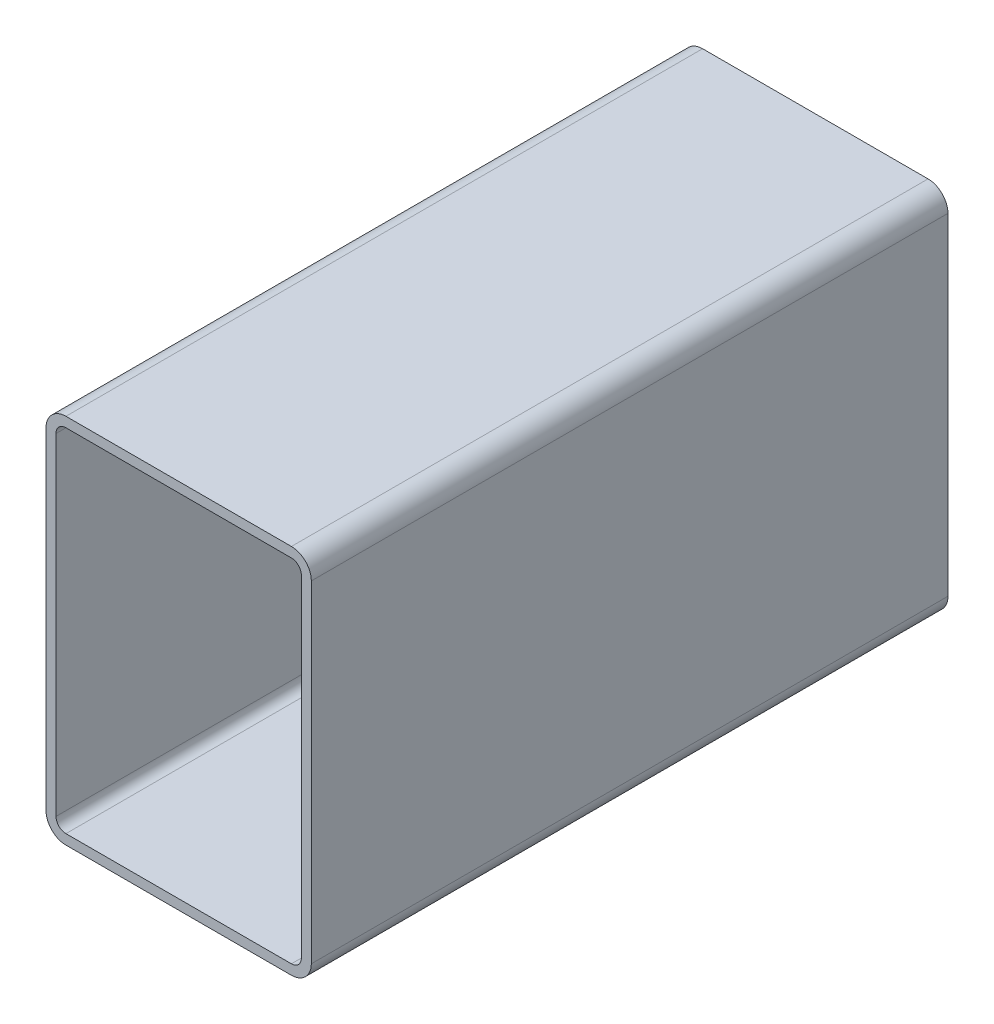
ISO-10303-21;
HEADER;
FILE_DESCRIPTION(('STEP AP214'),'2;1');
FILE_NAME('part.step','',(''),(''),'','','');
FILE_SCHEMA(('AUTOMOTIVE_DESIGN { 1 0 10303 214 1 1 1 1 }'));
ENDSEC;
DATA;
#1=APPLICATION_CONTEXT('core data for automotive mechanical design processes');
#2=APPLICATION_PROTOCOL_DEFINITION('international standard','automotive_design',2000,#1);
#3=PRODUCT_CONTEXT('',#1,'mechanical');
#4=PRODUCT('Part','Part','',(#3));
#5=PRODUCT_RELATED_PRODUCT_CATEGORY('part','',(#4));
#6=PRODUCT_DEFINITION_FORMATION('','',#4);
#7=PRODUCT_DEFINITION_CONTEXT('part definition',#1,'design');
#8=PRODUCT_DEFINITION('design','',#6,#7);
#9=PRODUCT_DEFINITION_SHAPE('','',#8);
#10=(LENGTH_UNIT() NAMED_UNIT(*) SI_UNIT(.MILLI.,.METRE.));
#11=(NAMED_UNIT(*) PLANE_ANGLE_UNIT() SI_UNIT($,.RADIAN.));
#12=(NAMED_UNIT(*) SI_UNIT($,.STERADIAN.) SOLID_ANGLE_UNIT());
#13=UNCERTAINTY_MEASURE_WITH_UNIT(LENGTH_MEASURE(1.E-05),#10,'distance_accuracy_value','');
#14=(GEOMETRIC_REPRESENTATION_CONTEXT(3) GLOBAL_UNCERTAINTY_ASSIGNED_CONTEXT((#13)) GLOBAL_UNIT_ASSIGNED_CONTEXT((#10,
#11,#12)) REPRESENTATION_CONTEXT('',''));
#15=CARTESIAN_POINT('',(0.,0.,0.));
#16=DIRECTION('',(0.,0.,1.));
#17=DIRECTION('',(1.,0.,0.));
#18=AXIS2_PLACEMENT_3D('',#15,#16,#17);
#19=CARTESIAN_POINT('',(10.3862396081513,170.264039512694,304.8));
#20=DIRECTION('',(0.,0.,1.));
#21=DIRECTION('',(1.,0.,0.));
#22=AXIS2_PLACEMENT_3D('',#19,#20,#21);
#23=PLANE('',#22);
#24=CARTESIAN_POINT('',(10.3862396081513,170.264039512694,304.8));
#25=DIRECTION('',(0.,0.,1.));
#26=DIRECTION('',(1.,0.,0.));
#27=AXIS2_PLACEMENT_3D('',#24,#25,#26);
#28=CIRCLE('',#27,9.525);
#29=CARTESIAN_POINT('',(10.3862396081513,179.789039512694,304.8));
#30=VERTEX_POINT('',#29);
#31=CARTESIAN_POINT('',(0.8612396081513,170.264039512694,304.8));
#32=VERTEX_POINT('',#31);
#33=EDGE_CURVE('E211',#30,#32,#28,.T.);
#34=ORIENTED_EDGE('',*,*,#33,.T.);
#35=DIRECTION('',(0.,-1.,0.));
#36=VECTOR('',#35,1.);
#37=CARTESIAN_POINT('',(0.8612396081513,11.5140395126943,304.8));
#38=LINE('',#37,#36);
#39=CARTESIAN_POINT('',(0.861239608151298,11.5140395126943,304.8));
#40=VERTEX_POINT('',#39);
#41=EDGE_CURVE('E214',#32,#40,#38,.T.);
#42=ORIENTED_EDGE('',*,*,#41,.T.);
#43=CARTESIAN_POINT('',(10.3862396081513,11.5140395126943,304.8));
#44=DIRECTION('',(0.,0.,1.));
#45=DIRECTION('',(1.,0.,0.));
#46=AXIS2_PLACEMENT_3D('',#43,#44,#45);
#47=CIRCLE('',#46,9.525);
#48=CARTESIAN_POINT('',(10.3862396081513,1.98903951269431,304.8));
#49=VERTEX_POINT('',#48);
#50=EDGE_CURVE('E217',#40,#49,#47,.T.);
#51=ORIENTED_EDGE('',*,*,#50,.T.);
#52=DIRECTION('',(1.,0.,0.));
#53=VECTOR('',#52,1.);
#54=CARTESIAN_POINT('',(118.336239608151,1.98903951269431,304.8));
#55=LINE('',#54,#53);
#56=CARTESIAN_POINT('',(118.336239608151,1.98903951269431,304.8));
#57=VERTEX_POINT('',#56);
#58=EDGE_CURVE('E219',#49,#57,#55,.T.);
#59=ORIENTED_EDGE('',*,*,#58,.T.);
#60=CARTESIAN_POINT('',(118.336239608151,11.5140395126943,304.8));
#61=DIRECTION('',(0.,0.,1.));
#62=DIRECTION('',(1.,0.,0.));
#63=AXIS2_PLACEMENT_3D('',#60,#61,#62);
#64=CIRCLE('',#63,9.525);
#65=CARTESIAN_POINT('',(127.861239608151,11.5140395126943,304.8));
#66=VERTEX_POINT('',#65);
#67=EDGE_CURVE('E221',#57,#66,#64,.T.);
#68=ORIENTED_EDGE('',*,*,#67,.T.);
#69=DIRECTION('',(0.,1.,0.));
#70=VECTOR('',#69,1.);
#71=CARTESIAN_POINT('',(127.861239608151,170.264039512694,304.8));
#72=LINE('',#71,#70);
#73=CARTESIAN_POINT('',(127.861239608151,170.264039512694,304.8));
#74=VERTEX_POINT('',#73);
#75=EDGE_CURVE('E223',#66,#74,#72,.T.);
#76=ORIENTED_EDGE('',*,*,#75,.T.);
#77=CARTESIAN_POINT('',(118.336239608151,170.264039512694,304.8));
#78=DIRECTION('',(0.,0.,1.));
#79=DIRECTION('',(1.,0.,0.));
#80=AXIS2_PLACEMENT_3D('',#77,#78,#79);
#81=CIRCLE('',#80,9.525);
#82=CARTESIAN_POINT('',(118.336239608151,179.789039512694,304.8));
#83=VERTEX_POINT('',#82);
#84=EDGE_CURVE('E225',#74,#83,#81,.T.);
#85=ORIENTED_EDGE('',*,*,#84,.T.);
#86=DIRECTION('',(-1.,0.,0.));
#87=VECTOR('',#86,1.);
#88=CARTESIAN_POINT('',(10.3862396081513,179.789039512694,304.8));
#89=LINE('',#88,#87);
#90=EDGE_CURVE('E227',#83,#30,#89,.T.);
#91=ORIENTED_EDGE('',*,*,#90,.T.);
#92=EDGE_LOOP('',(#34,#42,#51,#59,#68,#76,#85,#91));
#93=FACE_BOUND('',#92,.T.);
#94=DIRECTION('',(0.,-1.,0.));
#95=VECTOR('',#94,1.);
#96=CARTESIAN_POINT('',(5.6237396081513,11.5140395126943,304.8));
#97=LINE('',#96,#95);
#98=CARTESIAN_POINT('',(5.6237396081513,170.264039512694,304.8));
#99=VERTEX_POINT('',#98);
#100=CARTESIAN_POINT('',(5.6237396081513,11.5140395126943,304.8));
#101=VERTEX_POINT('',#100);
#102=EDGE_CURVE('E154',#99,#101,#97,.T.);
#103=ORIENTED_EDGE('',*,*,#102,.F.);
#104=CARTESIAN_POINT('',(10.3862396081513,170.264039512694,304.8));
#105=DIRECTION('',(0.,0.,1.));
#106=DIRECTION('',(1.,0.,0.));
#107=AXIS2_PLACEMENT_3D('',#104,#105,#106);
#108=CIRCLE('',#107,4.7625);
#109=CARTESIAN_POINT('',(10.3862396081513,175.026539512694,304.8));
#110=VERTEX_POINT('',#109);
#111=EDGE_CURVE('E146',#110,#99,#108,.T.);
#112=ORIENTED_EDGE('',*,*,#111,.F.);
#113=DIRECTION('',(-1.,0.,0.));
#114=VECTOR('',#113,1.);
#115=CARTESIAN_POINT('',(10.3862396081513,175.026539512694,304.8));
#116=LINE('',#115,#114);
#117=CARTESIAN_POINT('',(118.336239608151,175.026539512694,304.8));
#118=VERTEX_POINT('',#117);
#119=EDGE_CURVE('E179',#118,#110,#116,.T.);
#120=ORIENTED_EDGE('',*,*,#119,.F.);
#121=CARTESIAN_POINT('',(118.336239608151,170.264039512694,304.8));
#122=DIRECTION('',(0.,0.,1.));
#123=DIRECTION('',(1.,0.,0.));
#124=AXIS2_PLACEMENT_3D('',#121,#122,#123);
#125=CIRCLE('',#124,4.7625);
#126=CARTESIAN_POINT('',(123.098739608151,170.264039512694,304.8));
#127=VERTEX_POINT('',#126);
#128=EDGE_CURVE('E177',#127,#118,#125,.T.);
#129=ORIENTED_EDGE('',*,*,#128,.F.);
#130=DIRECTION('',(0.,1.,0.));
#131=VECTOR('',#130,1.);
#132=CARTESIAN_POINT('',(123.098739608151,170.264039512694,304.8));
#133=LINE('',#132,#131);
#134=CARTESIAN_POINT('',(123.098739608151,11.5140395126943,304.8));
#135=VERTEX_POINT('',#134);
#136=EDGE_CURVE('E175',#135,#127,#133,.T.);
#137=ORIENTED_EDGE('',*,*,#136,.F.);
#138=CARTESIAN_POINT('',(118.336239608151,11.5140395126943,304.8));
#139=DIRECTION('',(0.,0.,1.));
#140=DIRECTION('',(1.,0.,0.));
#141=AXIS2_PLACEMENT_3D('',#138,#139,#140);
#142=CIRCLE('',#141,4.7625);
#143=CARTESIAN_POINT('',(118.336239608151,6.75153951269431,304.8));
#144=VERTEX_POINT('',#143);
#145=EDGE_CURVE('E173',#144,#135,#142,.T.);
#146=ORIENTED_EDGE('',*,*,#145,.F.);
#147=DIRECTION('',(1.,0.,0.));
#148=VECTOR('',#147,1.);
#149=CARTESIAN_POINT('',(118.336239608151,6.75153951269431,304.8));
#150=LINE('',#149,#148);
#151=CARTESIAN_POINT('',(10.3862396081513,6.75153951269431,304.8));
#152=VERTEX_POINT('',#151);
#153=EDGE_CURVE('E169',#152,#144,#150,.T.);
#154=ORIENTED_EDGE('',*,*,#153,.F.);
#155=CARTESIAN_POINT('',(10.3862396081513,11.5140395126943,304.8));
#156=DIRECTION('',(0.,0.,1.));
#157=DIRECTION('',(1.,0.,0.));
#158=AXIS2_PLACEMENT_3D('',#155,#156,#157);
#159=CIRCLE('',#158,4.7625);
#160=EDGE_CURVE('E167',#101,#152,#159,.T.);
#161=ORIENTED_EDGE('',*,*,#160,.F.);
#162=EDGE_LOOP('',(#103,#112,#120,#129,#137,#146,#154,#161));
#163=FACE_BOUND('',#162,.T.);
#164=ADVANCED_FACE('F33',(#93,#163),#23,.T.);
#165=CARTESIAN_POINT('',(10.3862396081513,170.264039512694,0.));
#166=DIRECTION('',(0.,0.,1.));
#167=DIRECTION('',(1.,0.,0.));
#168=AXIS2_PLACEMENT_3D('',#165,#166,#167);
#169=PLANE('',#168);
#170=CARTESIAN_POINT('',(10.3862396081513,170.264039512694,0.));
#171=DIRECTION('',(0.,0.,1.));
#172=DIRECTION('',(1.,0.,0.));
#173=AXIS2_PLACEMENT_3D('',#170,#171,#172);
#174=CIRCLE('',#173,9.525);
#175=CARTESIAN_POINT('',(10.3862396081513,179.789039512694,0.));
#176=VERTEX_POINT('',#175);
#177=CARTESIAN_POINT('',(0.8612396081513,170.264039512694,0.));
#178=VERTEX_POINT('',#177);
#179=EDGE_CURVE('E162',#176,#178,#174,.T.);
#180=ORIENTED_EDGE('',*,*,#179,.F.);
#181=DIRECTION('',(-1.,0.,0.));
#182=VECTOR('',#181,1.);
#183=CARTESIAN_POINT('',(10.3862396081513,179.789039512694,0.));
#184=LINE('',#183,#182);
#185=CARTESIAN_POINT('',(118.336239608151,179.789039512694,0.));
#186=VERTEX_POINT('',#185);
#187=EDGE_CURVE('E215',#186,#176,#184,.T.);
#188=ORIENTED_EDGE('',*,*,#187,.F.);
#189=CARTESIAN_POINT('',(118.336239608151,170.264039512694,0.));
#190=DIRECTION('',(0.,0.,1.));
#191=DIRECTION('',(1.,0.,0.));
#192=AXIS2_PLACEMENT_3D('',#189,#190,#191);
#193=CIRCLE('',#192,9.525);
#194=CARTESIAN_POINT('',(127.861239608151,170.264039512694,0.));
#195=VERTEX_POINT('',#194);
#196=EDGE_CURVE('E242',#195,#186,#193,.T.);
#197=ORIENTED_EDGE('',*,*,#196,.F.);
#198=DIRECTION('',(0.,1.,0.));
#199=VECTOR('',#198,1.);
#200=CARTESIAN_POINT('',(127.861239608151,170.264039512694,0.));
#201=LINE('',#200,#199);
#202=CARTESIAN_POINT('',(127.861239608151,11.5140395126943,0.));
#203=VERTEX_POINT('',#202);
#204=EDGE_CURVE('E240',#203,#195,#201,.T.);
#205=ORIENTED_EDGE('',*,*,#204,.F.);
#206=CARTESIAN_POINT('',(118.336239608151,11.5140395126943,0.));
#207=DIRECTION('',(0.,0.,1.));
#208=DIRECTION('',(1.,0.,0.));
#209=AXIS2_PLACEMENT_3D('',#206,#207,#208);
#210=CIRCLE('',#209,9.525);
#211=CARTESIAN_POINT('',(118.336239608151,1.98903951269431,0.));
#212=VERTEX_POINT('',#211);
#213=EDGE_CURVE('E238',#212,#203,#210,.T.);
#214=ORIENTED_EDGE('',*,*,#213,.F.);
#215=DIRECTION('',(1.,0.,0.));
#216=VECTOR('',#215,1.);
#217=CARTESIAN_POINT('',(118.336239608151,1.98903951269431,0.));
#218=LINE('',#217,#216);
#219=CARTESIAN_POINT('',(10.3862396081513,1.98903951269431,0.));
#220=VERTEX_POINT('',#219);
#221=EDGE_CURVE('E236',#220,#212,#218,.T.);
#222=ORIENTED_EDGE('',*,*,#221,.F.);
#223=CARTESIAN_POINT('',(10.3862396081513,11.5140395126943,0.));
#224=DIRECTION('',(0.,0.,1.));
#225=DIRECTION('',(1.,0.,0.));
#226=AXIS2_PLACEMENT_3D('',#223,#224,#225);
#227=CIRCLE('',#226,9.525);
#228=CARTESIAN_POINT('',(0.861239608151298,11.5140395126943,0.));
#229=VERTEX_POINT('',#228);
#230=EDGE_CURVE('E234',#229,#220,#227,.T.);
#231=ORIENTED_EDGE('',*,*,#230,.F.);
#232=DIRECTION('',(0.,-1.,0.));
#233=VECTOR('',#232,1.);
#234=CARTESIAN_POINT('',(0.8612396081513,11.5140395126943,0.));
#235=LINE('',#234,#233);
#236=EDGE_CURVE('E232',#178,#229,#235,.T.);
#237=ORIENTED_EDGE('',*,*,#236,.F.);
#238=EDGE_LOOP('',(#180,#188,#197,#205,#214,#222,#231,#237));
#239=FACE_BOUND('',#238,.T.);
#240=CARTESIAN_POINT('',(10.3862396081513,170.264039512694,0.));
#241=DIRECTION('',(0.,0.,1.));
#242=DIRECTION('',(1.,0.,0.));
#243=AXIS2_PLACEMENT_3D('',#240,#241,#242);
#244=CIRCLE('',#243,4.7625);
#245=CARTESIAN_POINT('',(10.3862396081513,175.026539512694,0.));
#246=VERTEX_POINT('',#245);
#247=CARTESIAN_POINT('',(5.6237396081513,170.264039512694,0.));
#248=VERTEX_POINT('',#247);
#249=EDGE_CURVE('E56',#246,#248,#244,.T.);
#250=ORIENTED_EDGE('',*,*,#249,.T.);
#251=DIRECTION('',(0.,-1.,0.));
#252=VECTOR('',#251,1.);
#253=CARTESIAN_POINT('',(5.6237396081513,11.5140395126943,0.));
#254=LINE('',#253,#252);
#255=CARTESIAN_POINT('',(5.6237396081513,11.5140395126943,0.));
#256=VERTEX_POINT('',#255);
#257=EDGE_CURVE('E161',#248,#256,#254,.T.);
#258=ORIENTED_EDGE('',*,*,#257,.T.);
#259=CARTESIAN_POINT('',(10.3862396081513,11.5140395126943,0.));
#260=DIRECTION('',(0.,0.,1.));
#261=DIRECTION('',(1.,0.,0.));
#262=AXIS2_PLACEMENT_3D('',#259,#260,#261);
#263=CIRCLE('',#262,4.7625);
#264=CARTESIAN_POINT('',(10.3862396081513,6.75153951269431,0.));
#265=VERTEX_POINT('',#264);
#266=EDGE_CURVE('E183',#256,#265,#263,.T.);
#267=ORIENTED_EDGE('',*,*,#266,.T.);
#268=DIRECTION('',(1.,0.,0.));
#269=VECTOR('',#268,1.);
#270=CARTESIAN_POINT('',(118.336239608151,6.75153951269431,0.));
#271=LINE('',#270,#269);
#272=CARTESIAN_POINT('',(118.336239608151,6.75153951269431,0.));
#273=VERTEX_POINT('',#272);
#274=EDGE_CURVE('E186',#265,#273,#271,.T.);
#275=ORIENTED_EDGE('',*,*,#274,.T.);
#276=CARTESIAN_POINT('',(118.336239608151,11.5140395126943,0.));
#277=DIRECTION('',(0.,0.,1.));
#278=DIRECTION('',(1.,0.,0.));
#279=AXIS2_PLACEMENT_3D('',#276,#277,#278);
#280=CIRCLE('',#279,4.7625);
#281=CARTESIAN_POINT('',(123.098739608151,11.5140395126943,0.));
#282=VERTEX_POINT('',#281);
#283=EDGE_CURVE('E189',#273,#282,#280,.T.);
#284=ORIENTED_EDGE('',*,*,#283,.T.);
#285=DIRECTION('',(0.,1.,0.));
#286=VECTOR('',#285,1.);
#287=CARTESIAN_POINT('',(123.098739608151,170.264039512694,0.));
#288=LINE('',#287,#286);
#289=CARTESIAN_POINT('',(123.098739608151,170.264039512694,0.));
#290=VERTEX_POINT('',#289);
#291=EDGE_CURVE('E192',#282,#290,#288,.T.);
#292=ORIENTED_EDGE('',*,*,#291,.T.);
#293=CARTESIAN_POINT('',(118.336239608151,170.264039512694,0.));
#294=DIRECTION('',(0.,0.,1.));
#295=DIRECTION('',(1.,0.,0.));
#296=AXIS2_PLACEMENT_3D('',#293,#294,#295);
#297=CIRCLE('',#296,4.7625);
#298=CARTESIAN_POINT('',(118.336239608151,175.026539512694,0.));
#299=VERTEX_POINT('',#298);
#300=EDGE_CURVE('E195',#290,#299,#297,.T.);
#301=ORIENTED_EDGE('',*,*,#300,.T.);
#302=DIRECTION('',(-1.,0.,0.));
#303=VECTOR('',#302,1.);
#304=CARTESIAN_POINT('',(10.3862396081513,175.026539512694,0.));
#305=LINE('',#304,#303);
#306=EDGE_CURVE('E155',#299,#246,#305,.T.);
#307=ORIENTED_EDGE('',*,*,#306,.T.);
#308=EDGE_LOOP('',(#250,#258,#267,#275,#284,#292,#301,#307));
#309=FACE_BOUND('',#308,.T.);
#310=ADVANCED_FACE('F272',(#239,#309),#169,.F.);
#311=CARTESIAN_POINT('',(10.3862396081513,170.264039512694,304.8));
#312=DIRECTION('',(0.,0.,-1.));
#313=DIRECTION('',(-1.,0.,0.));
#314=AXIS2_PLACEMENT_3D('',#311,#312,#313);
#315=CYLINDRICAL_SURFACE('',#314,9.525);
#316=ORIENTED_EDGE('',*,*,#179,.T.);
#317=DIRECTION('',(0.,0.,-1.));
#318=VECTOR('',#317,1.);
#319=CARTESIAN_POINT('',(0.8612396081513,170.264039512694,304.8));
#320=LINE('',#319,#318);
#321=EDGE_CURVE('E11',#32,#178,#320,.T.);
#322=ORIENTED_EDGE('',*,*,#321,.F.);
#323=ORIENTED_EDGE('',*,*,#33,.F.);
#324=DIRECTION('',(0.,0.,-1.));
#325=VECTOR('',#324,1.);
#326=CARTESIAN_POINT('',(10.3862396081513,179.789039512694,304.8));
#327=LINE('',#326,#325);
#328=EDGE_CURVE('E229',#30,#176,#327,.T.);
#329=ORIENTED_EDGE('',*,*,#328,.T.);
#330=EDGE_LOOP('',(#316,#322,#323,#329));
#331=FACE_BOUND('',#330,.T.);
#332=ADVANCED_FACE('F35',(#331),#315,.T.);
#333=CARTESIAN_POINT('',(0.8612396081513,11.5140395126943,304.8));
#334=DIRECTION('',(1.,0.,0.));
#335=DIRECTION('',(0.,0.,-1.));
#336=AXIS2_PLACEMENT_3D('',#333,#334,#335);
#337=PLANE('',#336);
#338=ORIENTED_EDGE('',*,*,#236,.T.);
#339=DIRECTION('',(0.,0.,-1.));
#340=VECTOR('',#339,1.);
#341=CARTESIAN_POINT('',(0.861239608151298,11.5140395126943,304.8));
#342=LINE('',#341,#340);
#343=EDGE_CURVE('E41',#40,#229,#342,.T.);
#344=ORIENTED_EDGE('',*,*,#343,.F.);
#345=ORIENTED_EDGE('',*,*,#41,.F.);
#346=ORIENTED_EDGE('',*,*,#321,.T.);
#347=EDGE_LOOP('',(#338,#344,#345,#346));
#348=FACE_BOUND('',#347,.T.);
#349=ADVANCED_FACE('F289',(#348),#337,.F.);
#350=CARTESIAN_POINT('',(10.3862396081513,11.5140395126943,304.8));
#351=DIRECTION('',(0.,0.,-1.));
#352=DIRECTION('',(-1.,0.,0.));
#353=AXIS2_PLACEMENT_3D('',#350,#351,#352);
#354=CYLINDRICAL_SURFACE('',#353,9.525);
#355=ORIENTED_EDGE('',*,*,#230,.T.);
#356=DIRECTION('',(0.,0.,-1.));
#357=VECTOR('',#356,1.);
#358=CARTESIAN_POINT('',(10.3862396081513,1.98903951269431,304.8));
#359=LINE('',#358,#357);
#360=EDGE_CURVE('E259',#49,#220,#359,.T.);
#361=ORIENTED_EDGE('',*,*,#360,.F.);
#362=ORIENTED_EDGE('',*,*,#50,.F.);
#363=ORIENTED_EDGE('',*,*,#343,.T.);
#364=EDGE_LOOP('',(#355,#361,#362,#363));
#365=FACE_BOUND('',#364,.T.);
#366=ADVANCED_FACE('F266',(#365),#354,.T.);
#367=CARTESIAN_POINT('',(118.336239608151,1.98903951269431,304.8));
#368=DIRECTION('',(0.,1.,0.));
#369=DIRECTION('',(0.,0.,1.));
#370=AXIS2_PLACEMENT_3D('',#367,#368,#369);
#371=PLANE('',#370);
#372=ORIENTED_EDGE('',*,*,#221,.T.);
#373=DIRECTION('',(0.,0.,-1.));
#374=VECTOR('',#373,1.);
#375=CARTESIAN_POINT('',(118.336239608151,1.98903951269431,304.8));
#376=LINE('',#375,#374);
#377=EDGE_CURVE('E256',#57,#212,#376,.T.);
#378=ORIENTED_EDGE('',*,*,#377,.F.);
#379=ORIENTED_EDGE('',*,*,#58,.F.);
#380=ORIENTED_EDGE('',*,*,#360,.T.);
#381=EDGE_LOOP('',(#372,#378,#379,#380));
#382=FACE_BOUND('',#381,.T.);
#383=ADVANCED_FACE('F278',(#382),#371,.F.);
#384=CARTESIAN_POINT('',(118.336239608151,11.5140395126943,304.8));
#385=DIRECTION('',(0.,0.,-1.));
#386=DIRECTION('',(-1.,0.,0.));
#387=AXIS2_PLACEMENT_3D('',#384,#385,#386);
#388=CYLINDRICAL_SURFACE('',#387,9.525);
#389=ORIENTED_EDGE('',*,*,#213,.T.);
#390=DIRECTION('',(0.,0.,-1.));
#391=VECTOR('',#390,1.);
#392=CARTESIAN_POINT('',(127.861239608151,11.5140395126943,304.8));
#393=LINE('',#392,#391);
#394=EDGE_CURVE('E253',#66,#203,#393,.T.);
#395=ORIENTED_EDGE('',*,*,#394,.F.);
#396=ORIENTED_EDGE('',*,*,#67,.F.);
#397=ORIENTED_EDGE('',*,*,#377,.T.);
#398=EDGE_LOOP('',(#389,#395,#396,#397));
#399=FACE_BOUND('',#398,.T.);
#400=ADVANCED_FACE('F282',(#399),#388,.T.);
#401=CARTESIAN_POINT('',(127.861239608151,170.264039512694,304.8));
#402=DIRECTION('',(-1.,0.,0.));
#403=DIRECTION('',(0.,0.,1.));
#404=AXIS2_PLACEMENT_3D('',#401,#402,#403);
#405=PLANE('',#404);
#406=ORIENTED_EDGE('',*,*,#204,.T.);
#407=DIRECTION('',(0.,0.,-1.));
#408=VECTOR('',#407,1.);
#409=CARTESIAN_POINT('',(127.861239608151,170.264039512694,304.8));
#410=LINE('',#409,#408);
#411=EDGE_CURVE('E250',#74,#195,#410,.T.);
#412=ORIENTED_EDGE('',*,*,#411,.F.);
#413=ORIENTED_EDGE('',*,*,#75,.F.);
#414=ORIENTED_EDGE('',*,*,#394,.T.);
#415=EDGE_LOOP('',(#406,#412,#413,#414));
#416=FACE_BOUND('',#415,.T.);
#417=ADVANCED_FACE('F302',(#416),#405,.F.);
#418=CARTESIAN_POINT('',(118.336239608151,170.264039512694,304.8));
#419=DIRECTION('',(0.,0.,-1.));
#420=DIRECTION('',(-1.,0.,0.));
#421=AXIS2_PLACEMENT_3D('',#418,#419,#420);
#422=CYLINDRICAL_SURFACE('',#421,9.525);
#423=ORIENTED_EDGE('',*,*,#196,.T.);
#424=DIRECTION('',(0.,0.,-1.));
#425=VECTOR('',#424,1.);
#426=CARTESIAN_POINT('',(118.336239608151,179.789039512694,304.8));
#427=LINE('',#426,#425);
#428=EDGE_CURVE('E247',#83,#186,#427,.T.);
#429=ORIENTED_EDGE('',*,*,#428,.F.);
#430=ORIENTED_EDGE('',*,*,#84,.F.);
#431=ORIENTED_EDGE('',*,*,#411,.T.);
#432=EDGE_LOOP('',(#423,#429,#430,#431));
#433=FACE_BOUND('',#432,.T.);
#434=ADVANCED_FACE('F300',(#433),#422,.T.);
#435=CARTESIAN_POINT('',(10.3862396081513,179.789039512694,304.8));
#436=DIRECTION('',(0.,-1.,0.));
#437=DIRECTION('',(0.,0.,-1.));
#438=AXIS2_PLACEMENT_3D('',#435,#436,#437);
#439=PLANE('',#438);
#440=ORIENTED_EDGE('',*,*,#187,.T.);
#441=ORIENTED_EDGE('',*,*,#328,.F.);
#442=ORIENTED_EDGE('',*,*,#90,.F.);
#443=ORIENTED_EDGE('',*,*,#428,.T.);
#444=EDGE_LOOP('',(#440,#441,#442,#443));
#445=FACE_BOUND('',#444,.T.);
#446=ADVANCED_FACE('F295',(#445),#439,.F.);
#447=CARTESIAN_POINT('',(10.3862396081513,170.264039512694,304.8));
#448=DIRECTION('',(0.,0.,-1.));
#449=DIRECTION('',(-1.,0.,0.));
#450=AXIS2_PLACEMENT_3D('',#447,#448,#449);
#451=CYLINDRICAL_SURFACE('',#450,4.7625);
#452=ORIENTED_EDGE('',*,*,#249,.F.);
#453=DIRECTION('',(0.,0.,-1.));
#454=VECTOR('',#453,1.);
#455=CARTESIAN_POINT('',(10.3862396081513,175.026539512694,304.8));
#456=LINE('',#455,#454);
#457=EDGE_CURVE('E150',#110,#246,#456,.T.);
#458=ORIENTED_EDGE('',*,*,#457,.F.);
#459=ORIENTED_EDGE('',*,*,#111,.T.);
#460=DIRECTION('',(0.,0.,-1.));
#461=VECTOR('',#460,1.);
#462=CARTESIAN_POINT('',(5.6237396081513,170.264039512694,304.8));
#463=LINE('',#462,#461);
#464=EDGE_CURVE('E149',#99,#248,#463,.T.);
#465=ORIENTED_EDGE('',*,*,#464,.T.);
#466=EDGE_LOOP('',(#452,#458,#459,#465));
#467=FACE_BOUND('',#466,.T.);
#468=ADVANCED_FACE('F148',(#467),#451,.F.);
#469=CARTESIAN_POINT('',(5.6237396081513,11.5140395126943,304.8));
#470=DIRECTION('',(1.,0.,0.));
#471=DIRECTION('',(0.,0.,-1.));
#472=AXIS2_PLACEMENT_3D('',#469,#470,#471);
#473=PLANE('',#472);
#474=ORIENTED_EDGE('',*,*,#257,.F.);
#475=ORIENTED_EDGE('',*,*,#464,.F.);
#476=ORIENTED_EDGE('',*,*,#102,.T.);
#477=DIRECTION('',(0.,0.,-1.));
#478=VECTOR('',#477,1.);
#479=CARTESIAN_POINT('',(5.6237396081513,11.5140395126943,304.8));
#480=LINE('',#479,#478);
#481=EDGE_CURVE('E163',#101,#256,#480,.T.);
#482=ORIENTED_EDGE('',*,*,#481,.T.);
#483=EDGE_LOOP('',(#474,#475,#476,#482));
#484=FACE_BOUND('',#483,.T.);
#485=ADVANCED_FACE('F158',(#484),#473,.T.);
#486=CARTESIAN_POINT('',(10.3862396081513,11.5140395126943,304.8));
#487=DIRECTION('',(0.,0.,-1.));
#488=DIRECTION('',(-1.,0.,0.));
#489=AXIS2_PLACEMENT_3D('',#486,#487,#488);
#490=CYLINDRICAL_SURFACE('',#489,4.7625);
#491=ORIENTED_EDGE('',*,*,#266,.F.);
#492=ORIENTED_EDGE('',*,*,#481,.F.);
#493=ORIENTED_EDGE('',*,*,#160,.T.);
#494=DIRECTION('',(0.,0.,-1.));
#495=VECTOR('',#494,1.);
#496=CARTESIAN_POINT('',(10.3862396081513,6.75153951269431,304.8));
#497=LINE('',#496,#495);
#498=EDGE_CURVE('E208',#152,#265,#497,.T.);
#499=ORIENTED_EDGE('',*,*,#498,.T.);
#500=EDGE_LOOP('',(#491,#492,#493,#499));
#501=FACE_BOUND('',#500,.T.);
#502=ADVANCED_FACE('F327',(#501),#490,.F.);
#503=CARTESIAN_POINT('',(118.336239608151,6.75153951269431,304.8));
#504=DIRECTION('',(0.,1.,0.));
#505=DIRECTION('',(0.,0.,1.));
#506=AXIS2_PLACEMENT_3D('',#503,#504,#505);
#507=PLANE('',#506);
#508=ORIENTED_EDGE('',*,*,#274,.F.);
#509=ORIENTED_EDGE('',*,*,#498,.F.);
#510=ORIENTED_EDGE('',*,*,#153,.T.);
#511=DIRECTION('',(0.,0.,-1.));
#512=VECTOR('',#511,1.);
#513=CARTESIAN_POINT('',(118.336239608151,6.75153951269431,304.8));
#514=LINE('',#513,#512);
#515=EDGE_CURVE('E206',#144,#273,#514,.T.);
#516=ORIENTED_EDGE('',*,*,#515,.T.);
#517=EDGE_LOOP('',(#508,#509,#510,#516));
#518=FACE_BOUND('',#517,.T.);
#519=ADVANCED_FACE('F331',(#518),#507,.T.);
#520=CARTESIAN_POINT('',(118.336239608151,11.5140395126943,304.8));
#521=DIRECTION('',(0.,0.,-1.));
#522=DIRECTION('',(-1.,0.,0.));
#523=AXIS2_PLACEMENT_3D('',#520,#521,#522);
#524=CYLINDRICAL_SURFACE('',#523,4.7625);
#525=ORIENTED_EDGE('',*,*,#283,.F.);
#526=ORIENTED_EDGE('',*,*,#515,.F.);
#527=ORIENTED_EDGE('',*,*,#145,.T.);
#528=DIRECTION('',(0.,0.,-1.));
#529=VECTOR('',#528,1.);
#530=CARTESIAN_POINT('',(123.098739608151,11.5140395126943,304.8));
#531=LINE('',#530,#529);
#532=EDGE_CURVE('E204',#135,#282,#531,.T.);
#533=ORIENTED_EDGE('',*,*,#532,.T.);
#534=EDGE_LOOP('',(#525,#526,#527,#533));
#535=FACE_BOUND('',#534,.T.);
#536=ADVANCED_FACE('F337',(#535),#524,.F.);
#537=CARTESIAN_POINT('',(123.098739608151,170.264039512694,304.8));
#538=DIRECTION('',(-1.,0.,0.));
#539=DIRECTION('',(0.,0.,1.));
#540=AXIS2_PLACEMENT_3D('',#537,#538,#539);
#541=PLANE('',#540);
#542=ORIENTED_EDGE('',*,*,#291,.F.);
#543=ORIENTED_EDGE('',*,*,#532,.F.);
#544=ORIENTED_EDGE('',*,*,#136,.T.);
#545=DIRECTION('',(0.,0.,-1.));
#546=VECTOR('',#545,1.);
#547=CARTESIAN_POINT('',(123.098739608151,170.264039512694,304.8));
#548=LINE('',#547,#546);
#549=EDGE_CURVE('E202',#127,#290,#548,.T.);
#550=ORIENTED_EDGE('',*,*,#549,.T.);
#551=EDGE_LOOP('',(#542,#543,#544,#550));
#552=FACE_BOUND('',#551,.T.);
#553=ADVANCED_FACE('F341',(#552),#541,.T.);
#554=CARTESIAN_POINT('',(118.336239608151,170.264039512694,304.8));
#555=DIRECTION('',(0.,0.,-1.));
#556=DIRECTION('',(-1.,0.,0.));
#557=AXIS2_PLACEMENT_3D('',#554,#555,#556);
#558=CYLINDRICAL_SURFACE('',#557,4.7625);
#559=ORIENTED_EDGE('',*,*,#300,.F.);
#560=ORIENTED_EDGE('',*,*,#549,.F.);
#561=ORIENTED_EDGE('',*,*,#128,.T.);
#562=DIRECTION('',(0.,0.,-1.));
#563=VECTOR('',#562,1.);
#564=CARTESIAN_POINT('',(118.336239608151,175.026539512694,304.8));
#565=LINE('',#564,#563);
#566=EDGE_CURVE('E48',#118,#299,#565,.T.);
#567=ORIENTED_EDGE('',*,*,#566,.T.);
#568=EDGE_LOOP('',(#559,#560,#561,#567));
#569=FACE_BOUND('',#568,.T.);
#570=ADVANCED_FACE('F345',(#569),#558,.F.);
#571=CARTESIAN_POINT('',(10.3862396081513,175.026539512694,304.8));
#572=DIRECTION('',(0.,-1.,0.));
#573=DIRECTION('',(0.,0.,-1.));
#574=AXIS2_PLACEMENT_3D('',#571,#572,#573);
#575=PLANE('',#574);
#576=ORIENTED_EDGE('',*,*,#306,.F.);
#577=ORIENTED_EDGE('',*,*,#566,.F.);
#578=ORIENTED_EDGE('',*,*,#119,.T.);
#579=ORIENTED_EDGE('',*,*,#457,.T.);
#580=EDGE_LOOP('',(#576,#577,#578,#579));
#581=FACE_BOUND('',#580,.T.);
#582=ADVANCED_FACE('F349',(#581),#575,.T.);
#583=CLOSED_SHELL('',(#164,#310,#332,#349,#366,#383,#400,#417,#434,#446,#468,#485,#502,#519,
#536,#553,#570,#582));
#584=MANIFOLD_SOLID_BREP('B2',#583);
#585=ADVANCED_BREP_SHAPE_REPRESENTATION('',(#18,#584),#14);
#586=SHAPE_DEFINITION_REPRESENTATION(#9,#585);
ENDSEC;
END-ISO-10303-21;
